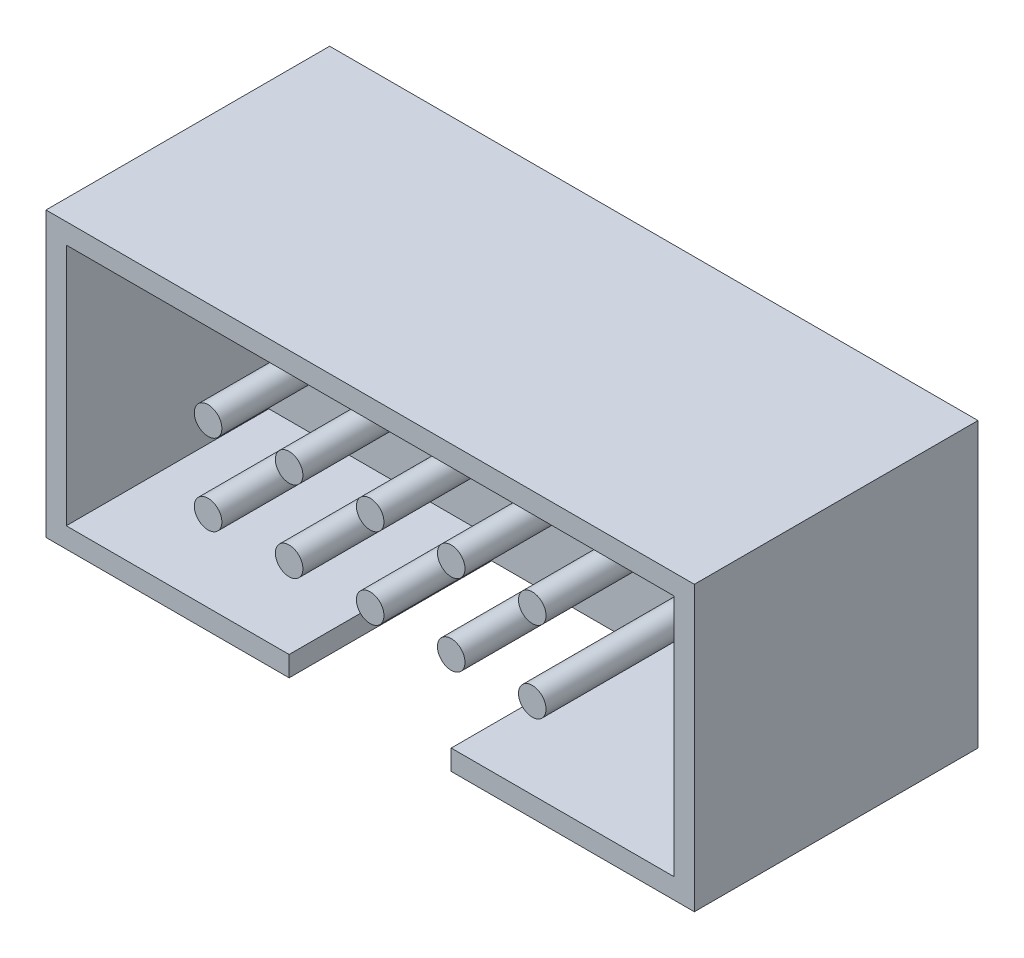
from build123d import *

# Parameters (mm, degrees)
SKETCH1_W                   = 20.32
SKETCH1_H                   = 8.89
BOSS_EXTRUDE1_DEPTH         = 2.54
SKETCH4_W                   = 0.635
SKETCH4_H                   = 8.89
BOSS_EXTRUDE2_DEPTH         = 6.35
SKETCH5_W                   = 19.05
SKETCH5_H                   = 0.635
SKETCH5_W_2                 = 6.985
BOSS_EXTRUDE3_DEPTH         = 6.35
BOSS_EXTRUDE4_DEPTH         = 2.54
BOSS_EXTRUDE4_DEPTH_BACK    = 8.89
SKETCH6_R                   = 0.4318
BOSS_EXTRUDE4_2_DEPTH       = 2.54
BOSS_EXTRUDE4_2_DEPTH_BACK  = 8.89
BOSS_EXTRUDE4_3_DEPTH       = 2.54
BOSS_EXTRUDE4_3_DEPTH_BACK  = 8.89
BOSS_EXTRUDE4_4_DEPTH       = 2.54
BOSS_EXTRUDE4_4_DEPTH_BACK  = 8.89
BOSS_EXTRUDE4_5_DEPTH       = 2.54
BOSS_EXTRUDE4_5_DEPTH_BACK  = 8.89
BOSS_EXTRUDE4_6_DEPTH       = 2.54
BOSS_EXTRUDE4_6_DEPTH_BACK  = 8.89
BOSS_EXTRUDE4_7_DEPTH       = 2.54
BOSS_EXTRUDE4_7_DEPTH_BACK  = 8.89
BOSS_EXTRUDE4_8_DEPTH       = 2.54
BOSS_EXTRUDE4_8_DEPTH_BACK  = 8.89
BOSS_EXTRUDE4_9_DEPTH       = 2.54
BOSS_EXTRUDE4_9_DEPTH_BACK  = 8.89
BOSS_EXTRUDE4_10_DEPTH      = 2.54
BOSS_EXTRUDE4_10_DEPTH_BACK = 8.89


with BuildPart() as part:
    # Sketch1 → Boss-Extrude1 (new body)
    with BuildSketch(Plane.XY):
        with Locations((5.08, 1.27)):
            Rectangle(SKETCH1_W, SKETCH1_H)
    extrude(amount=BOSS_EXTRUDE1_DEPTH)

    # Sketch4 → Boss-Extrude2 (add)
    with BuildSketch(Plane.XY.offset(2.54)):
        with Locations((-4.7625, 1.27)):
            Rectangle(SKETCH4_W, SKETCH4_H)
        with Locations((14.9225, 1.27)):
            Rectangle(SKETCH4_W, SKETCH4_H)
    extrude(amount=BOSS_EXTRUDE2_DEPTH)

    # Sketch5 → Boss-Extrude3 (add)
    with BuildSketch(Plane.XY.offset(2.54)):
        with Locations((5.08, 5.3975)):
            Rectangle(SKETCH5_W, SKETCH5_H)
        with Locations((-0.9525, -2.8575)):
            Rectangle(SKETCH5_W_2, SKETCH5_H)
        with Locations((11.1125, -2.8575)):
            Rectangle(SKETCH5_W_2, SKETCH5_H)
    extrude(amount=BOSS_EXTRUDE3_DEPTH)


with BuildPart() as body_2:
    # Sketch6 → Boss-Extrude4 (new, two sides: drawn at the far end of the back side and taken through both)
    with BuildSketch(Plane(origin=(0, 0, 0), x_dir=(-1, 0, 0), z_dir=(0, 0, -1)).offset(-BOSS_EXTRUDE4_DEPTH_BACK)):
        Circle(SKETCH6_R)
    extrude(amount=BOSS_EXTRUDE4_DEPTH + BOSS_EXTRUDE4_DEPTH_BACK)


with BuildPart() as body_3:
    # Sketch6 → Boss-Extrude4 2 (new, two sides: drawn at the far end of the back side and taken through both)
    with BuildSketch(Plane(origin=(0, 0, 0), x_dir=(-1, 0, 0), z_dir=(0, 0, -1)).offset(-BOSS_EXTRUDE4_2_DEPTH_BACK)):
        with Locations((0, 2.54)):
            Circle(SKETCH6_R)
    extrude(amount=BOSS_EXTRUDE4_2_DEPTH + BOSS_EXTRUDE4_2_DEPTH_BACK)


with BuildPart() as body_4:
    # Sketch6 → Boss-Extrude4 3 (new, two sides: drawn at the far end of the back side and taken through both)
    with BuildSketch(Plane(origin=(0, 0, 0), x_dir=(-1, 0, 0), z_dir=(0, 0, -1)).offset(-BOSS_EXTRUDE4_3_DEPTH_BACK)):
        with Locations((-2.54, 0)):
            Circle(SKETCH6_R)
    extrude(amount=BOSS_EXTRUDE4_3_DEPTH + BOSS_EXTRUDE4_3_DEPTH_BACK)


with BuildPart() as body_5:
    # Sketch6 → Boss-Extrude4 4 (new, two sides: drawn at the far end of the back side and taken through both)
    with BuildSketch(Plane(origin=(0, 0, 0), x_dir=(-1, 0, 0), z_dir=(0, 0, -1)).offset(-BOSS_EXTRUDE4_4_DEPTH_BACK)):
        with Locations((-5.08, 0)):
            Circle(SKETCH6_R)
    extrude(amount=BOSS_EXTRUDE4_4_DEPTH + BOSS_EXTRUDE4_4_DEPTH_BACK)


with BuildPart() as body_6:
    # Sketch6 → Boss-Extrude4 5 (new, two sides: drawn at the far end of the back side and taken through both)
    with BuildSketch(Plane(origin=(0, 0, 0), x_dir=(-1, 0, 0), z_dir=(0, 0, -1)).offset(-BOSS_EXTRUDE4_5_DEPTH_BACK)):
        with Locations((-7.62, 0)):
            Circle(SKETCH6_R)
    extrude(amount=BOSS_EXTRUDE4_5_DEPTH + BOSS_EXTRUDE4_5_DEPTH_BACK)


with BuildPart() as body_7:
    # Sketch6 → Boss-Extrude4 6 (new, two sides: drawn at the far end of the back side and taken through both)
    with BuildSketch(Plane(origin=(0, 0, 0), x_dir=(-1, 0, 0), z_dir=(0, 0, -1)).offset(-BOSS_EXTRUDE4_6_DEPTH_BACK)):
        with Locations((-10.16, 0)):
            Circle(SKETCH6_R)
    extrude(amount=BOSS_EXTRUDE4_6_DEPTH + BOSS_EXTRUDE4_6_DEPTH_BACK)


with BuildPart() as body_8:
    # Sketch6 → Boss-Extrude4 7 (new, two sides: drawn at the far end of the back side and taken through both)
    with BuildSketch(Plane(origin=(0, 0, 0), x_dir=(-1, 0, 0), z_dir=(0, 0, -1)).offset(-BOSS_EXTRUDE4_7_DEPTH_BACK)):
        with Locations((-2.54, 2.54)):
            Circle(SKETCH6_R)
    extrude(amount=BOSS_EXTRUDE4_7_DEPTH + BOSS_EXTRUDE4_7_DEPTH_BACK)


with BuildPart() as body_9:
    # Sketch6 → Boss-Extrude4 8 (new, two sides: drawn at the far end of the back side and taken through both)
    with BuildSketch(Plane(origin=(0, 0, 0), x_dir=(-1, 0, 0), z_dir=(0, 0, -1)).offset(-BOSS_EXTRUDE4_8_DEPTH_BACK)):
        with Locations((-5.08, 2.54)):
            Circle(SKETCH6_R)
    extrude(amount=BOSS_EXTRUDE4_8_DEPTH + BOSS_EXTRUDE4_8_DEPTH_BACK)


with BuildPart() as body_10:
    # Sketch6 → Boss-Extrude4 9 (new, two sides: drawn at the far end of the back side and taken through both)
    with BuildSketch(Plane(origin=(0, 0, 0), x_dir=(-1, 0, 0), z_dir=(0, 0, -1)).offset(-BOSS_EXTRUDE4_9_DEPTH_BACK)):
        with Locations((-7.62, 2.54)):
            Circle(SKETCH6_R)
    extrude(amount=BOSS_EXTRUDE4_9_DEPTH + BOSS_EXTRUDE4_9_DEPTH_BACK)


with BuildPart() as body_11:
    # Sketch6 → Boss-Extrude4 10 (new, two sides: drawn at the far end of the back side and taken through both)
    with BuildSketch(Plane(origin=(0, 0, 0), x_dir=(-1, 0, 0), z_dir=(0, 0, -1)).offset(-BOSS_EXTRUDE4_10_DEPTH_BACK)):
        with Locations((-10.16, 2.54)):
            Circle(SKETCH6_R)
    extrude(amount=BOSS_EXTRUDE4_10_DEPTH + BOSS_EXTRUDE4_10_DEPTH_BACK)


solid = Compound([part.part, body_2.part, body_3.part, body_4.part, body_5.part, body_6.part, body_7.part, body_8.part, body_9.part, body_10.part, body_11.part])
